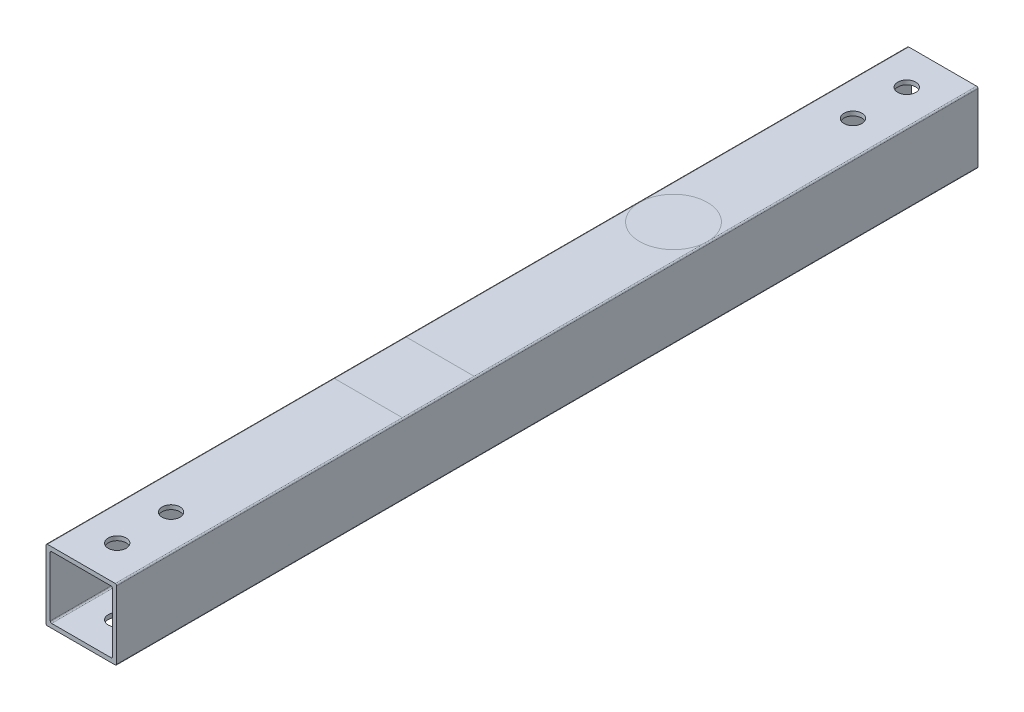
from build123d import *

# Parameters (mm, degrees)
BOSS_EXTRUDE1_DEPTH = 304.8
CUT_EXTRUDE1_REACH  = 2002.195
SKETCH2_R           = 3.175


with BuildPart() as part:
    # Sketch1 → Boss-Extrude1 (new body)
    with BuildSketch(Plane(origin=(0, 0, -2000), x_dir=(-1, 0, 0), z_dir=(0, 0, -1))):
        with BuildLine():
            Line((12.5, -12), (12.5, 12))
            ThreePointArc((12.5, 12), (12.353553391, 12.353553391), (12, 12.5))
            Line((12, 12.5), (-12, 12.5))
            ThreePointArc((-12, 12.5), (-12.353553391, 12.353553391), (-12.5, 12))
            Line((-12.5, 12), (-12.5, -12))
            ThreePointArc((-12.5, -12), (-12.353553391, -12.353553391), (-12, -12.5))
            Line((-12, -12.5), (12, -12.5))
            ThreePointArc((12, -12.5), (12.353553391, -12.353553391), (12.5, -12))
        make_face()
        with BuildLine():
            Line((11, 10.5), (11, -10.5))
            ThreePointArc((11, -10.5), (10.853553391, -10.853553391), (10.5, -11))
            Line((10.5, -11), (-10.5, -11))
            ThreePointArc((-10.5, -11), (-10.853553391, -10.853553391), (-11, -10.5))
            Line((-11, -10.5), (-11, 10.5))
            ThreePointArc((-11, 10.5), (-10.853553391, 10.853553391), (-10.5, 11))
            Line((-10.5, 11), (10.5, 11))
            ThreePointArc((10.5, 11), (10.853553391, 10.853553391), (11, 10.5))
        make_face(mode=Mode.SUBTRACT)
    extrude(amount=-BOSS_EXTRUDE1_DEPTH)

    # Cut-Extrude1: up to this face of the body (flat: up to its plane)
    cut_extrude1_end = Plane(part.part.faces().sort_by_distance((0, -12.5, -1847.6))[0])
    # Sketch2 → Cut-Extrude1 (cut, up to the picked face)
    with BuildSketch(Plane(origin=(0, 12.5, 0), x_dir=(1, 0, 0), z_dir=(0, 1, 0)), mode=Mode.PRIVATE) as cut_extrude1_sk1:
        with Locations(Location((0, 1987.3, 0), (0, 0, 180))):
            Circle(SKETCH2_R)
    cut_extrude1_tool1 = split(extrude(cut_extrude1_sk1.sketch, amount=-CUT_EXTRUDE1_REACH, mode=Mode.PRIVATE), bisect_by=cut_extrude1_end, keep=Keep.BOTH, mode=Mode.PRIVATE)
    # Sketch2 → Cut-Extrude1 (cut, up to the picked face)
    with BuildSketch(Plane(origin=(0, 12.5, 0), x_dir=(1, 0, 0), z_dir=(0, 1, 0)), mode=Mode.PRIVATE) as cut_extrude1_sk2:
        with Locations(Location((0, 1968.25, 0), (0, 0, 180))):
            Circle(SKETCH2_R)
    cut_extrude1_tool2 = split(extrude(cut_extrude1_sk2.sketch, amount=-CUT_EXTRUDE1_REACH, mode=Mode.PRIVATE), bisect_by=cut_extrude1_end, keep=Keep.BOTH, mode=Mode.PRIVATE)
    # Sketch2 → Cut-Extrude1 (cut, up to the picked face)
    with BuildSketch(Plane(origin=(0, 12.5, 0), x_dir=(1, 0, 0), z_dir=(0, 1, 0)), mode=Mode.PRIVATE) as cut_extrude1_sk3:
        with Locations(Location((0, 1707.9, 0), (0, 0, 180))):
            Circle(SKETCH2_R)
    cut_extrude1_tool3 = split(extrude(cut_extrude1_sk3.sketch, amount=-CUT_EXTRUDE1_REACH, mode=Mode.PRIVATE), bisect_by=cut_extrude1_end, keep=Keep.BOTH, mode=Mode.PRIVATE)
    # Sketch2 → Cut-Extrude1 (cut, up to the picked face)
    with BuildSketch(Plane(origin=(0, 12.5, 0), x_dir=(1, 0, 0), z_dir=(0, 1, 0)), mode=Mode.PRIVATE) as cut_extrude1_sk4:
        with Locations(Location((0, 1726.95, 0), (0, 0, 180))):
            Circle(SKETCH2_R)
    cut_extrude1_tool4 = split(extrude(cut_extrude1_sk4.sketch, amount=-CUT_EXTRUDE1_REACH, mode=Mode.PRIVATE), bisect_by=cut_extrude1_end, keep=Keep.BOTH, mode=Mode.PRIVATE)
    add(cut_extrude1_tool1.solids().sort_by(Axis((0, 12.5, -1987.3), (0, -1, 0)))[0], mode=Mode.SUBTRACT)
    add(cut_extrude1_tool2.solids().sort_by(Axis((0, 12.5, -1968.25), (0, -1, 0)))[0], mode=Mode.SUBTRACT)
    add(cut_extrude1_tool3.solids().sort_by(Axis((0, 12.5, -1707.9), (0, -1, 0)))[0], mode=Mode.SUBTRACT)
    add(cut_extrude1_tool4.solids().sort_by(Axis((0, 12.5, -1726.95), (0, -1, 0)))[0], mode=Mode.SUBTRACT)


solid = part.part
